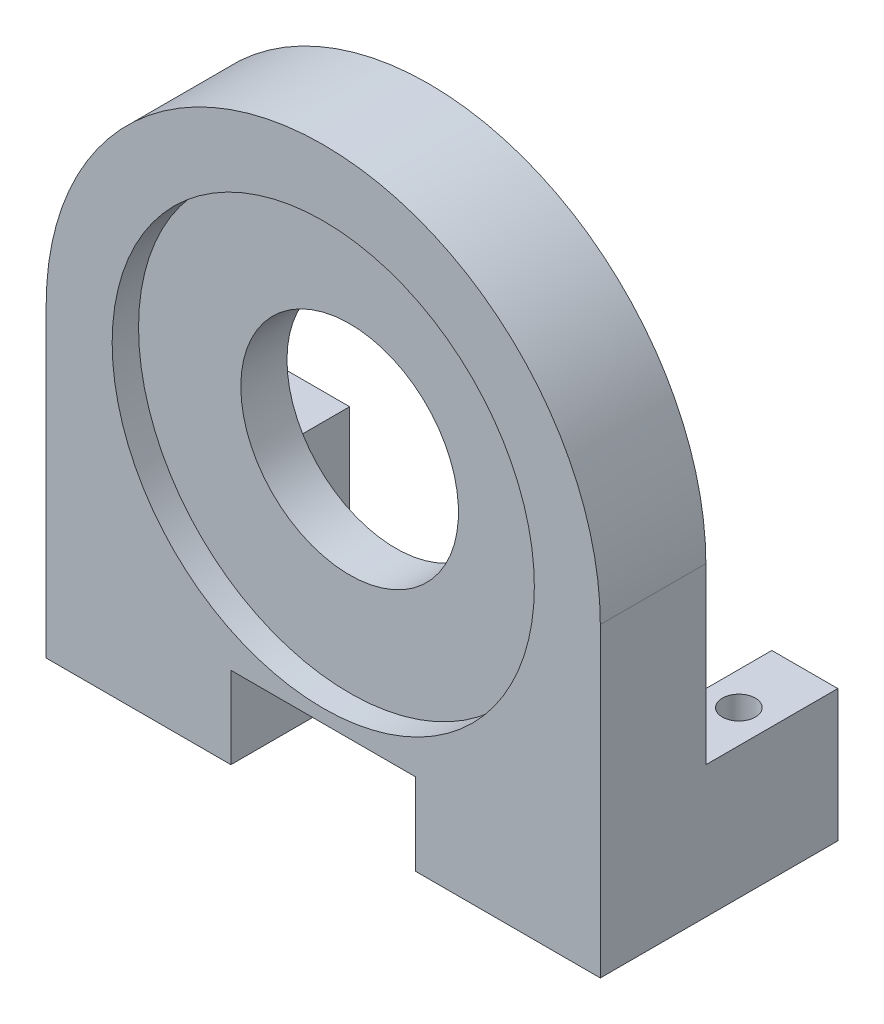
ISO-10303-21;
HEADER;
FILE_DESCRIPTION(('STEP AP214'),'2;1');
FILE_NAME('part.step','',(''),(''),'','','');
FILE_SCHEMA(('AUTOMOTIVE_DESIGN { 1 0 10303 214 1 1 1 1 }'));
ENDSEC;
DATA;
#1=APPLICATION_CONTEXT('core data for automotive mechanical design processes');
#2=APPLICATION_PROTOCOL_DEFINITION('international standard','automotive_design',2000,#1);
#3=PRODUCT_CONTEXT('',#1,'mechanical');
#4=PRODUCT('Part','Part','',(#3));
#5=PRODUCT_RELATED_PRODUCT_CATEGORY('part','',(#4));
#6=PRODUCT_DEFINITION_FORMATION('','',#4);
#7=PRODUCT_DEFINITION_CONTEXT('part definition',#1,'design');
#8=PRODUCT_DEFINITION('design','',#6,#7);
#9=PRODUCT_DEFINITION_SHAPE('','',#8);
#10=(LENGTH_UNIT() NAMED_UNIT(*) SI_UNIT(.MILLI.,.METRE.));
#11=(NAMED_UNIT(*) PLANE_ANGLE_UNIT() SI_UNIT($,.RADIAN.));
#12=(NAMED_UNIT(*) SI_UNIT($,.STERADIAN.) SOLID_ANGLE_UNIT());
#13=UNCERTAINTY_MEASURE_WITH_UNIT(LENGTH_MEASURE(1.E-05),#10,'distance_accuracy_value','');
#14=(GEOMETRIC_REPRESENTATION_CONTEXT(3) GLOBAL_UNCERTAINTY_ASSIGNED_CONTEXT((#13)) GLOBAL_UNIT_ASSIGNED_CONTEXT((#10,
#11,#12)) REPRESENTATION_CONTEXT('',''));
#15=CARTESIAN_POINT('',(0.,0.,0.));
#16=DIRECTION('',(0.,0.,1.));
#17=DIRECTION('',(1.,0.,0.));
#18=AXIS2_PLACEMENT_3D('',#15,#16,#17);
#19=CARTESIAN_POINT('',(-21.,0.,4.));
#20=DIRECTION('',(0.,1.,0.));
#21=DIRECTION('',(-1.,0.,0.));
#22=AXIS2_PLACEMENT_3D('',#19,#20,#21);
#23=PLANE('',#22);
#24=CARTESIAN_POINT('',(18.5,0.,-0.999999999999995));
#25=DIRECTION('',(0.,-1.,0.));
#26=DIRECTION('',(0.,0.,1.));
#27=AXIS2_PLACEMENT_3D('',#24,#25,#26);
#28=CIRCLE('',#27,1.25);
#29=CARTESIAN_POINT('',(18.5,0.,0.250000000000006));
#30=VERTEX_POINT('',#29);
#31=EDGE_CURVE('E169',#30,#30,#28,.T.);
#32=ORIENTED_EDGE('',*,*,#31,.F.);
#33=EDGE_LOOP('',(#32));
#34=FACE_BOUND('',#33,.T.);
#35=CARTESIAN_POINT('',(18.5,0.,-9.));
#36=DIRECTION('',(0.,-1.,0.));
#37=DIRECTION('',(0.,0.,1.));
#38=AXIS2_PLACEMENT_3D('',#35,#36,#37);
#39=CIRCLE('',#38,1.25);
#40=CARTESIAN_POINT('',(18.5,0.,-7.74999999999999));
#41=VERTEX_POINT('',#40);
#42=EDGE_CURVE('E177',#41,#41,#39,.T.);
#43=ORIENTED_EDGE('',*,*,#42,.F.);
#44=EDGE_LOOP('',(#43));
#45=FACE_BOUND('',#44,.T.);
#46=DIRECTION('',(1.,0.,0.));
#47=VECTOR('',#46,1.);
#48=CARTESIAN_POINT('',(-21.,0.,4.));
#49=LINE('',#48,#47);
#50=CARTESIAN_POINT('',(7.,0.,4.));
#51=VERTEX_POINT('',#50);
#52=CARTESIAN_POINT('',(21.,0.,4.));
#53=VERTEX_POINT('',#52);
#54=EDGE_CURVE('E258',#51,#53,#49,.T.);
#55=ORIENTED_EDGE('',*,*,#54,.F.);
#56=DIRECTION('',(0.,0.,-1.));
#57=VECTOR('',#56,1.);
#58=CARTESIAN_POINT('',(7.,0.,4.));
#59=LINE('',#58,#57);
#60=CARTESIAN_POINT('',(7.,0.,-4.));
#61=VERTEX_POINT('',#60);
#62=EDGE_CURVE('E12',#51,#61,#59,.T.);
#63=ORIENTED_EDGE('',*,*,#62,.T.);
#64=DIRECTION('',(1.,0.,0.));
#65=VECTOR('',#64,1.);
#66=CARTESIAN_POINT('',(-21.,0.,-4.));
#67=LINE('',#66,#65);
#68=CARTESIAN_POINT('',(16.,0.,-4.));
#69=VERTEX_POINT('',#68);
#70=EDGE_CURVE('E268',#61,#69,#67,.T.);
#71=ORIENTED_EDGE('',*,*,#70,.T.);
#72=DIRECTION('',(0.,0.,1.));
#73=VECTOR('',#72,1.);
#74=CARTESIAN_POINT('',(16.,0.,-14.));
#75=LINE('',#74,#73);
#76=CARTESIAN_POINT('',(16.,0.,-14.));
#77=VERTEX_POINT('',#76);
#78=EDGE_CURVE('E234',#77,#69,#75,.T.);
#79=ORIENTED_EDGE('',*,*,#78,.F.);
#80=DIRECTION('',(-1.,0.,0.));
#81=VECTOR('',#80,1.);
#82=CARTESIAN_POINT('',(21.,0.,-14.));
#83=LINE('',#82,#81);
#84=CARTESIAN_POINT('',(21.,0.,-14.));
#85=VERTEX_POINT('',#84);
#86=EDGE_CURVE('E217',#85,#77,#83,.T.);
#87=ORIENTED_EDGE('',*,*,#86,.F.);
#88=DIRECTION('',(0.,0.,-1.));
#89=VECTOR('',#88,1.);
#90=CARTESIAN_POINT('',(21.,0.,4.));
#91=LINE('',#90,#89);
#92=EDGE_CURVE('E279',#53,#85,#91,.T.);
#93=ORIENTED_EDGE('',*,*,#92,.F.);
#94=EDGE_LOOP('',(#55,#63,#71,#79,#87,#93));
#95=FACE_BOUND('',#94,.T.);
#96=ADVANCED_FACE('F37',(#34,#45,#95),#23,.F.);
#97=CARTESIAN_POINT('',(0.,23.2,-4.));
#98=DIRECTION('',(0.,0.,-1.));
#99=DIRECTION('',(-1.,0.,0.));
#100=AXIS2_PLACEMENT_3D('',#97,#98,#99);
#101=PLANE('',#100);
#102=DIRECTION('',(0.,-1.,0.));
#103=VECTOR('',#102,1.);
#104=CARTESIAN_POINT('',(7.,-6.20000000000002,-4.));
#105=LINE('',#104,#103);
#106=CARTESIAN_POINT('',(7.,6.20000000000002,-4.));
#107=VERTEX_POINT('',#106);
#108=EDGE_CURVE('E161',#107,#61,#105,.T.);
#109=ORIENTED_EDGE('',*,*,#108,.F.);
#110=DIRECTION('',(1.,0.,0.));
#111=VECTOR('',#110,1.);
#112=CARTESIAN_POINT('',(7.,6.20000000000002,-4.));
#113=LINE('',#112,#111);
#114=CARTESIAN_POINT('',(-7.,6.20000000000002,-4.));
#115=VERTEX_POINT('',#114);
#116=EDGE_CURVE('E163',#115,#107,#113,.T.);
#117=ORIENTED_EDGE('',*,*,#116,.F.);
#118=DIRECTION('',(0.,1.,0.));
#119=VECTOR('',#118,1.);
#120=CARTESIAN_POINT('',(-7.,-6.20000000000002,-4.));
#121=LINE('',#120,#119);
#122=CARTESIAN_POINT('',(-7.,0.,-4.));
#123=VERTEX_POINT('',#122);
#124=EDGE_CURVE('E142',#123,#115,#121,.T.);
#125=ORIENTED_EDGE('',*,*,#124,.F.);
#126=CARTESIAN_POINT('',(-16.,0.,-4.));
#127=VERTEX_POINT('',#126);
#128=EDGE_CURVE('E269',#127,#123,#67,.T.);
#129=ORIENTED_EDGE('',*,*,#128,.F.);
#130=DIRECTION('',(0.,-1.,0.));
#131=VECTOR('',#130,1.);
#132=CARTESIAN_POINT('',(-16.,0.,-4.));
#133=LINE('',#132,#131);
#134=CARTESIAN_POINT('',(-16.,10.,-4.));
#135=VERTEX_POINT('',#134);
#136=EDGE_CURVE('E199',#135,#127,#133,.T.);
#137=ORIENTED_EDGE('',*,*,#136,.F.);
#138=DIRECTION('',(1.,0.,0.));
#139=VECTOR('',#138,1.);
#140=CARTESIAN_POINT('',(-21.,10.,-4.));
#141=LINE('',#140,#139);
#142=CARTESIAN_POINT('',(-21.,10.,-4.));
#143=VERTEX_POINT('',#142);
#144=EDGE_CURVE('E194',#143,#135,#141,.T.);
#145=ORIENTED_EDGE('',*,*,#144,.F.);
#146=DIRECTION('',(0.,-1.,0.));
#147=VECTOR('',#146,1.);
#148=CARTESIAN_POINT('',(-21.,0.,-4.));
#149=LINE('',#148,#147);
#150=CARTESIAN_POINT('',(-21.,23.2,-4.));
#151=VERTEX_POINT('',#150);
#152=EDGE_CURVE('E253',#151,#143,#149,.T.);
#153=ORIENTED_EDGE('',*,*,#152,.F.);
#154=CARTESIAN_POINT('',(0.,23.2,-4.));
#155=DIRECTION('',(0.,0.,1.));
#156=DIRECTION('',(-1.,0.,0.));
#157=AXIS2_PLACEMENT_3D('',#154,#155,#156);
#158=CIRCLE('',#157,21.);
#159=CARTESIAN_POINT('',(21.,23.2,-4.));
#160=VERTEX_POINT('',#159);
#161=EDGE_CURVE('E259',#160,#151,#158,.T.);
#162=ORIENTED_EDGE('',*,*,#161,.F.);
#163=DIRECTION('',(0.,1.,0.));
#164=VECTOR('',#163,1.);
#165=CARTESIAN_POINT('',(21.,23.2,-4.));
#166=LINE('',#165,#164);
#167=CARTESIAN_POINT('',(21.,10.,-4.));
#168=VERTEX_POINT('',#167);
#169=EDGE_CURVE('E271',#168,#160,#166,.T.);
#170=ORIENTED_EDGE('',*,*,#169,.F.);
#171=DIRECTION('',(1.,0.,0.));
#172=VECTOR('',#171,1.);
#173=CARTESIAN_POINT('',(21.,10.,-4.));
#174=LINE('',#173,#172);
#175=CARTESIAN_POINT('',(16.,10.,-4.));
#176=VERTEX_POINT('',#175);
#177=EDGE_CURVE('E218',#176,#168,#174,.T.);
#178=ORIENTED_EDGE('',*,*,#177,.F.);
#179=DIRECTION('',(0.,1.,0.));
#180=VECTOR('',#179,1.);
#181=CARTESIAN_POINT('',(16.,0.,-4.));
#182=LINE('',#181,#180);
#183=EDGE_CURVE('E213',#69,#176,#182,.T.);
#184=ORIENTED_EDGE('',*,*,#183,.F.);
#185=ORIENTED_EDGE('',*,*,#70,.F.);
#186=EDGE_LOOP('',(#109,#117,#125,#129,#137,#145,#153,#162,#170,#178,#184,#185));
#187=FACE_BOUND('',#186,.T.);
#188=CARTESIAN_POINT('',(0.,23.2,-4.));
#189=DIRECTION('',(0.,0.,1.));
#190=DIRECTION('',(1.,0.,0.));
#191=AXIS2_PLACEMENT_3D('',#188,#189,#190);
#192=CIRCLE('',#191,16.);
#193=CARTESIAN_POINT('',(16.,23.2,-4.));
#194=VERTEX_POINT('',#193);
#195=EDGE_CURVE('E249',#194,#194,#192,.T.);
#196=ORIENTED_EDGE('',*,*,#195,.T.);
#197=EDGE_LOOP('',(#196));
#198=FACE_BOUND('',#197,.T.);
#199=ADVANCED_FACE('F286',(#187,#198),#101,.T.);
#200=CARTESIAN_POINT('',(0.,23.2,4.));
#201=DIRECTION('',(0.,0.,-1.));
#202=DIRECTION('',(-1.,0.,0.));
#203=AXIS2_PLACEMENT_3D('',#200,#201,#202);
#204=CYLINDRICAL_SURFACE('',#203,16.);
#205=CARTESIAN_POINT('',(0.,23.2,4.));
#206=DIRECTION('',(0.,0.,1.));
#207=DIRECTION('',(1.,0.,0.));
#208=AXIS2_PLACEMENT_3D('',#205,#206,#207);
#209=CIRCLE('',#208,16.);
#210=CARTESIAN_POINT('',(16.,23.2,4.));
#211=VERTEX_POINT('',#210);
#212=EDGE_CURVE('E250',#211,#211,#209,.T.);
#213=ORIENTED_EDGE('',*,*,#212,.T.);
#214=EDGE_LOOP('',(#213));
#215=FACE_BOUND('',#214,.T.);
#216=CARTESIAN_POINT('',(0.,23.2,2.));
#217=DIRECTION('',(0.,0.,-1.));
#218=DIRECTION('',(-1.,0.,0.));
#219=AXIS2_PLACEMENT_3D('',#216,#217,#218);
#220=CIRCLE('',#219,16.);
#221=CARTESIAN_POINT('',(-16.,23.2,2.));
#222=VERTEX_POINT('',#221);
#223=EDGE_CURVE('E243',#222,#222,#220,.T.);
#224=ORIENTED_EDGE('',*,*,#223,.T.);
#225=EDGE_LOOP('',(#224));
#226=FACE_BOUND('',#225,.T.);
#227=ADVANCED_FACE('F341',(#215,#226),#204,.F.);
#228=ORIENTED_EDGE('',*,*,#195,.F.);
#229=EDGE_LOOP('',(#228));
#230=FACE_BOUND('',#229,.T.);
#231=CARTESIAN_POINT('',(0.,23.2,-1.5));
#232=DIRECTION('',(0.,0.,1.));
#233=DIRECTION('',(1.,0.,0.));
#234=AXIS2_PLACEMENT_3D('',#231,#232,#233);
#235=CIRCLE('',#234,16.);
#236=CARTESIAN_POINT('',(16.,23.2,-1.5));
#237=VERTEX_POINT('',#236);
#238=EDGE_CURVE('E240',#237,#237,#235,.T.);
#239=ORIENTED_EDGE('',*,*,#238,.T.);
#240=EDGE_LOOP('',(#239));
#241=FACE_BOUND('',#240,.T.);
#242=ADVANCED_FACE('F434',(#230,#241),#204,.F.);
#243=CARTESIAN_POINT('',(0.,23.2,4.));
#244=DIRECTION('',(0.,0.,-1.));
#245=DIRECTION('',(-1.,0.,0.));
#246=AXIS2_PLACEMENT_3D('',#243,#244,#245);
#247=PLANE('',#246);
#248=DIRECTION('',(1.,0.,0.));
#249=VECTOR('',#248,1.);
#250=CARTESIAN_POINT('',(7.,6.20000000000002,4.));
#251=LINE('',#250,#249);
#252=CARTESIAN_POINT('',(-7.,6.20000000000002,4.));
#253=VERTEX_POINT('',#252);
#254=CARTESIAN_POINT('',(7.,6.20000000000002,4.));
#255=VERTEX_POINT('',#254);
#256=EDGE_CURVE('E150',#253,#255,#251,.T.);
#257=ORIENTED_EDGE('',*,*,#256,.T.);
#258=DIRECTION('',(0.,-1.,0.));
#259=VECTOR('',#258,1.);
#260=CARTESIAN_POINT('',(7.,-6.20000000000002,4.));
#261=LINE('',#260,#259);
#262=EDGE_CURVE('E147',#255,#51,#261,.T.);
#263=ORIENTED_EDGE('',*,*,#262,.T.);
#264=ORIENTED_EDGE('',*,*,#54,.T.);
#265=DIRECTION('',(0.,1.,0.));
#266=VECTOR('',#265,1.);
#267=CARTESIAN_POINT('',(21.,23.2,4.));
#268=LINE('',#267,#266);
#269=CARTESIAN_POINT('',(21.,23.2,4.));
#270=VERTEX_POINT('',#269);
#271=EDGE_CURVE('E261',#53,#270,#268,.T.);
#272=ORIENTED_EDGE('',*,*,#271,.T.);
#273=CARTESIAN_POINT('',(0.,23.2,4.));
#274=DIRECTION('',(0.,0.,1.));
#275=DIRECTION('',(-1.,0.,0.));
#276=AXIS2_PLACEMENT_3D('',#273,#274,#275);
#277=CIRCLE('',#276,21.);
#278=CARTESIAN_POINT('',(-21.,23.2,4.));
#279=VERTEX_POINT('',#278);
#280=EDGE_CURVE('E263',#270,#279,#277,.T.);
#281=ORIENTED_EDGE('',*,*,#280,.T.);
#282=DIRECTION('',(0.,-1.,0.));
#283=VECTOR('',#282,1.);
#284=CARTESIAN_POINT('',(-21.,0.,4.));
#285=LINE('',#284,#283);
#286=CARTESIAN_POINT('',(-21.,0.,4.));
#287=VERTEX_POINT('',#286);
#288=EDGE_CURVE('E256',#279,#287,#285,.T.);
#289=ORIENTED_EDGE('',*,*,#288,.T.);
#290=CARTESIAN_POINT('',(-7.,0.,4.));
#291=VERTEX_POINT('',#290);
#292=EDGE_CURVE('E160',#287,#291,#49,.T.);
#293=ORIENTED_EDGE('',*,*,#292,.T.);
#294=DIRECTION('',(0.,1.,0.));
#295=VECTOR('',#294,1.);
#296=CARTESIAN_POINT('',(-7.,-6.20000000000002,4.));
#297=LINE('',#296,#295);
#298=EDGE_CURVE('E52',#291,#253,#297,.T.);
#299=ORIENTED_EDGE('',*,*,#298,.T.);
#300=EDGE_LOOP('',(#257,#263,#264,#272,#281,#289,#293,#299));
#301=FACE_BOUND('',#300,.T.);
#302=ORIENTED_EDGE('',*,*,#212,.F.);
#303=EDGE_LOOP('',(#302));
#304=FACE_BOUND('',#303,.T.);
#305=ADVANCED_FACE('F157',(#301,#304),#247,.F.);
#306=CARTESIAN_POINT('',(-21.,0.,4.));
#307=DIRECTION('',(1.,0.,0.));
#308=DIRECTION('',(0.,0.,-1.));
#309=AXIS2_PLACEMENT_3D('',#306,#307,#308);
#310=PLANE('',#309);
#311=ORIENTED_EDGE('',*,*,#152,.T.);
#312=DIRECTION('',(0.,0.,1.));
#313=VECTOR('',#312,1.);
#314=CARTESIAN_POINT('',(-21.,10.,-14.));
#315=LINE('',#314,#313);
#316=CARTESIAN_POINT('',(-21.,10.,-14.));
#317=VERTEX_POINT('',#316);
#318=EDGE_CURVE('E211',#317,#143,#315,.T.);
#319=ORIENTED_EDGE('',*,*,#318,.F.);
#320=DIRECTION('',(0.,1.,0.));
#321=VECTOR('',#320,1.);
#322=CARTESIAN_POINT('',(-21.,0.,-14.));
#323=LINE('',#322,#321);
#324=CARTESIAN_POINT('',(-21.,0.,-14.));
#325=VERTEX_POINT('',#324);
#326=EDGE_CURVE('E198',#325,#317,#323,.T.);
#327=ORIENTED_EDGE('',*,*,#326,.F.);
#328=DIRECTION('',(0.,0.,-1.));
#329=VECTOR('',#328,1.);
#330=CARTESIAN_POINT('',(-21.,0.,4.));
#331=LINE('',#330,#329);
#332=EDGE_CURVE('E281',#287,#325,#331,.T.);
#333=ORIENTED_EDGE('',*,*,#332,.F.);
#334=ORIENTED_EDGE('',*,*,#288,.F.);
#335=DIRECTION('',(0.,0.,-1.));
#336=VECTOR('',#335,1.);
#337=CARTESIAN_POINT('',(-21.,23.2,4.));
#338=LINE('',#337,#336);
#339=EDGE_CURVE('E265',#279,#151,#338,.T.);
#340=ORIENTED_EDGE('',*,*,#339,.T.);
#341=EDGE_LOOP('',(#311,#319,#327,#333,#334,#340));
#342=FACE_BOUND('',#341,.T.);
#343=ADVANCED_FACE('F39',(#342),#310,.F.);
#344=CARTESIAN_POINT('',(-18.5,0.,-1.));
#345=DIRECTION('',(0.,-1.,0.));
#346=DIRECTION('',(0.,0.,-1.));
#347=AXIS2_PLACEMENT_3D('',#344,#345,#346);
#348=CIRCLE('',#347,1.25);
#349=CARTESIAN_POINT('',(-18.5,0.,-2.25));
#350=VERTEX_POINT('',#349);
#351=EDGE_CURVE('E176',#350,#350,#348,.T.);
#352=ORIENTED_EDGE('',*,*,#351,.F.);
#353=EDGE_LOOP('',(#352));
#354=FACE_BOUND('',#353,.T.);
#355=CARTESIAN_POINT('',(-18.5,0.,-9.));
#356=DIRECTION('',(0.,-1.,0.));
#357=DIRECTION('',(0.,0.,-1.));
#358=AXIS2_PLACEMENT_3D('',#355,#356,#357);
#359=CIRCLE('',#358,1.25);
#360=CARTESIAN_POINT('',(-18.5,0.,-10.25));
#361=VERTEX_POINT('',#360);
#362=EDGE_CURVE('E184',#361,#361,#359,.T.);
#363=ORIENTED_EDGE('',*,*,#362,.F.);
#364=EDGE_LOOP('',(#363));
#365=FACE_BOUND('',#364,.T.);
#366=ORIENTED_EDGE('',*,*,#128,.T.);
#367=DIRECTION('',(0.,0.,1.));
#368=VECTOR('',#367,1.);
#369=CARTESIAN_POINT('',(-7.,0.,4.));
#370=LINE('',#369,#368);
#371=EDGE_CURVE('E45',#123,#291,#370,.T.);
#372=ORIENTED_EDGE('',*,*,#371,.T.);
#373=ORIENTED_EDGE('',*,*,#292,.F.);
#374=ORIENTED_EDGE('',*,*,#332,.T.);
#375=DIRECTION('',(-1.,0.,0.));
#376=VECTOR('',#375,1.);
#377=CARTESIAN_POINT('',(-21.,0.,-14.));
#378=LINE('',#377,#376);
#379=CARTESIAN_POINT('',(-16.,0.,-14.));
#380=VERTEX_POINT('',#379);
#381=EDGE_CURVE('E195',#380,#325,#378,.T.);
#382=ORIENTED_EDGE('',*,*,#381,.F.);
#383=DIRECTION('',(0.,0.,1.));
#384=VECTOR('',#383,1.);
#385=CARTESIAN_POINT('',(-16.,0.,-14.));
#386=LINE('',#385,#384);
#387=EDGE_CURVE('E60',#380,#127,#386,.T.);
#388=ORIENTED_EDGE('',*,*,#387,.T.);
#389=EDGE_LOOP('',(#366,#372,#373,#374,#382,#388));
#390=FACE_BOUND('',#389,.T.);
#391=ADVANCED_FACE('F282',(#354,#365,#390),#23,.F.);
#392=CARTESIAN_POINT('',(21.,23.2,4.));
#393=DIRECTION('',(-1.,0.,0.));
#394=DIRECTION('',(0.,0.,1.));
#395=AXIS2_PLACEMENT_3D('',#392,#393,#394);
#396=PLANE('',#395);
#397=ORIENTED_EDGE('',*,*,#92,.T.);
#398=DIRECTION('',(0.,-1.,0.));
#399=VECTOR('',#398,1.);
#400=CARTESIAN_POINT('',(21.,0.,-14.));
#401=LINE('',#400,#399);
#402=CARTESIAN_POINT('',(21.,10.,-14.));
#403=VERTEX_POINT('',#402);
#404=EDGE_CURVE('E214',#403,#85,#401,.T.);
#405=ORIENTED_EDGE('',*,*,#404,.F.);
#406=DIRECTION('',(0.,0.,1.));
#407=VECTOR('',#406,1.);
#408=CARTESIAN_POINT('',(21.,10.,-14.));
#409=LINE('',#408,#407);
#410=EDGE_CURVE('E224',#403,#168,#409,.T.);
#411=ORIENTED_EDGE('',*,*,#410,.T.);
#412=ORIENTED_EDGE('',*,*,#169,.T.);
#413=DIRECTION('',(0.,0.,-1.));
#414=VECTOR('',#413,1.);
#415=CARTESIAN_POINT('',(21.,23.2,4.));
#416=LINE('',#415,#414);
#417=EDGE_CURVE('E276',#270,#160,#416,.T.);
#418=ORIENTED_EDGE('',*,*,#417,.F.);
#419=ORIENTED_EDGE('',*,*,#271,.F.);
#420=EDGE_LOOP('',(#397,#405,#411,#412,#418,#419));
#421=FACE_BOUND('',#420,.T.);
#422=ADVANCED_FACE('F303',(#421),#396,.F.);
#423=CARTESIAN_POINT('',(0.,23.2,4.));
#424=DIRECTION('',(0.,0.,-1.));
#425=DIRECTION('',(-1.,0.,0.));
#426=AXIS2_PLACEMENT_3D('',#423,#424,#425);
#427=CYLINDRICAL_SURFACE('',#426,21.);
#428=ORIENTED_EDGE('',*,*,#161,.T.);
#429=ORIENTED_EDGE('',*,*,#339,.F.);
#430=ORIENTED_EDGE('',*,*,#280,.F.);
#431=ORIENTED_EDGE('',*,*,#417,.T.);
#432=EDGE_LOOP('',(#428,#429,#430,#431));
#433=FACE_BOUND('',#432,.T.);
#434=ADVANCED_FACE('F306',(#433),#427,.T.);
#435=CARTESIAN_POINT('',(0.,23.2,49.254833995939));
#436=DIRECTION('',(0.,0.,-1.));
#437=DIRECTION('',(-1.,0.,0.));
#438=AXIS2_PLACEMENT_3D('',#435,#436,#437);
#439=CYLINDRICAL_SURFACE('',#438,8.25);
#440=CARTESIAN_POINT('',(0.,23.2,2.));
#441=DIRECTION('',(0.,0.,-1.));
#442=DIRECTION('',(-1.,0.,0.));
#443=AXIS2_PLACEMENT_3D('',#440,#441,#442);
#444=CIRCLE('',#443,8.25);
#445=CARTESIAN_POINT('',(-8.25000000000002,23.2,2.));
#446=VERTEX_POINT('',#445);
#447=EDGE_CURVE('E246',#446,#446,#444,.T.);
#448=ORIENTED_EDGE('',*,*,#447,.F.);
#449=EDGE_LOOP('',(#448));
#450=FACE_BOUND('',#449,.T.);
#451=CARTESIAN_POINT('',(0.,23.2,-1.5));
#452=DIRECTION('',(0.,0.,1.));
#453=DIRECTION('',(1.,0.,0.));
#454=AXIS2_PLACEMENT_3D('',#451,#452,#453);
#455=CIRCLE('',#454,8.25);
#456=CARTESIAN_POINT('',(8.24999999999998,23.2,-1.5));
#457=VERTEX_POINT('',#456);
#458=EDGE_CURVE('E237',#457,#457,#455,.T.);
#459=ORIENTED_EDGE('',*,*,#458,.F.);
#460=EDGE_LOOP('',(#459));
#461=FACE_BOUND('',#460,.T.);
#462=ADVANCED_FACE('F543',(#450,#461),#439,.F.);
#463=CARTESIAN_POINT('',(0.,23.2,2.));
#464=DIRECTION('',(0.,0.,-1.));
#465=DIRECTION('',(-1.,0.,0.));
#466=AXIS2_PLACEMENT_3D('',#463,#464,#465);
#467=PLANE('',#466);
#468=ORIENTED_EDGE('',*,*,#447,.T.);
#469=EDGE_LOOP('',(#468));
#470=FACE_BOUND('',#469,.T.);
#471=ORIENTED_EDGE('',*,*,#223,.F.);
#472=EDGE_LOOP('',(#471));
#473=FACE_BOUND('',#472,.T.);
#474=ADVANCED_FACE('F536',(#470,#473),#467,.F.);
#475=CARTESIAN_POINT('',(0.,23.2,-1.5));
#476=DIRECTION('',(0.,0.,1.));
#477=DIRECTION('',(1.,0.,0.));
#478=AXIS2_PLACEMENT_3D('',#475,#476,#477);
#479=PLANE('',#478);
#480=ORIENTED_EDGE('',*,*,#458,.T.);
#481=EDGE_LOOP('',(#480));
#482=FACE_BOUND('',#481,.T.);
#483=ORIENTED_EDGE('',*,*,#238,.F.);
#484=EDGE_LOOP('',(#483));
#485=FACE_BOUND('',#484,.T.);
#486=ADVANCED_FACE('F466',(#482,#485),#479,.F.);
#487=CARTESIAN_POINT('',(16.,0.,-14.));
#488=DIRECTION('',(1.,0.,0.));
#489=DIRECTION('',(0.,0.,-1.));
#490=AXIS2_PLACEMENT_3D('',#487,#488,#489);
#491=PLANE('',#490);
#492=ORIENTED_EDGE('',*,*,#183,.T.);
#493=DIRECTION('',(0.,0.,1.));
#494=VECTOR('',#493,1.);
#495=CARTESIAN_POINT('',(16.,10.,-14.));
#496=LINE('',#495,#494);
#497=CARTESIAN_POINT('',(16.,10.,-14.));
#498=VERTEX_POINT('',#497);
#499=EDGE_CURVE('E231',#498,#176,#496,.T.);
#500=ORIENTED_EDGE('',*,*,#499,.F.);
#501=DIRECTION('',(0.,1.,0.));
#502=VECTOR('',#501,1.);
#503=CARTESIAN_POINT('',(16.,0.,-14.));
#504=LINE('',#503,#502);
#505=EDGE_CURVE('E220',#77,#498,#504,.T.);
#506=ORIENTED_EDGE('',*,*,#505,.F.);
#507=ORIENTED_EDGE('',*,*,#78,.T.);
#508=EDGE_LOOP('',(#492,#500,#506,#507));
#509=FACE_BOUND('',#508,.T.);
#510=ADVANCED_FACE('F461',(#509),#491,.F.);
#511=CARTESIAN_POINT('',(21.,10.,-14.));
#512=DIRECTION('',(0.,-1.,0.));
#513=DIRECTION('',(0.,0.,-1.));
#514=AXIS2_PLACEMENT_3D('',#511,#512,#513);
#515=PLANE('',#514);
#516=CARTESIAN_POINT('',(18.5,9.99999999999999,-9.));
#517=DIRECTION('',(0.,-1.,0.));
#518=DIRECTION('',(1.,0.,0.));
#519=AXIS2_PLACEMENT_3D('',#516,#517,#518);
#520=CIRCLE('',#519,1.25);
#521=CARTESIAN_POINT('',(19.75,9.99999999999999,-9.));
#522=VERTEX_POINT('',#521);
#523=EDGE_CURVE('E180',#522,#522,#520,.F.);
#524=ORIENTED_EDGE('',*,*,#523,.F.);
#525=EDGE_LOOP('',(#524));
#526=FACE_BOUND('',#525,.T.);
#527=ORIENTED_EDGE('',*,*,#177,.T.);
#528=ORIENTED_EDGE('',*,*,#410,.F.);
#529=DIRECTION('',(1.,0.,0.));
#530=VECTOR('',#529,1.);
#531=CARTESIAN_POINT('',(21.,10.,-14.));
#532=LINE('',#531,#530);
#533=EDGE_CURVE('E222',#498,#403,#532,.T.);
#534=ORIENTED_EDGE('',*,*,#533,.F.);
#535=ORIENTED_EDGE('',*,*,#499,.T.);
#536=EDGE_LOOP('',(#527,#528,#534,#535));
#537=FACE_BOUND('',#536,.T.);
#538=ADVANCED_FACE('F332',(#526,#537),#515,.F.);
#539=CARTESIAN_POINT('',(0.,0.,-14.));
#540=DIRECTION('',(0.,0.,1.));
#541=DIRECTION('',(1.,0.,0.));
#542=AXIS2_PLACEMENT_3D('',#539,#540,#541);
#543=PLANE('',#542);
#544=ORIENTED_EDGE('',*,*,#404,.T.);
#545=ORIENTED_EDGE('',*,*,#86,.T.);
#546=ORIENTED_EDGE('',*,*,#505,.T.);
#547=ORIENTED_EDGE('',*,*,#533,.T.);
#548=EDGE_LOOP('',(#544,#545,#546,#547));
#549=FACE_BOUND('',#548,.T.);
#550=ADVANCED_FACE('F324',(#549),#543,.F.);
#551=CARTESIAN_POINT('',(-21.,10.,-14.));
#552=DIRECTION('',(0.,-1.,0.));
#553=DIRECTION('',(1.,0.,0.));
#554=AXIS2_PLACEMENT_3D('',#551,#552,#553);
#555=PLANE('',#554);
#556=CARTESIAN_POINT('',(-18.5,10.,-9.));
#557=DIRECTION('',(0.,-1.,0.));
#558=DIRECTION('',(1.,0.,0.));
#559=AXIS2_PLACEMENT_3D('',#556,#557,#558);
#560=CIRCLE('',#559,1.25);
#561=CARTESIAN_POINT('',(-17.25,10.,-9.));
#562=VERTEX_POINT('',#561);
#563=EDGE_CURVE('E191',#562,#562,#560,.F.);
#564=ORIENTED_EDGE('',*,*,#563,.F.);
#565=EDGE_LOOP('',(#564));
#566=FACE_BOUND('',#565,.T.);
#567=ORIENTED_EDGE('',*,*,#144,.T.);
#568=DIRECTION('',(0.,0.,1.));
#569=VECTOR('',#568,1.);
#570=CARTESIAN_POINT('',(-16.,10.,-14.));
#571=LINE('',#570,#569);
#572=CARTESIAN_POINT('',(-16.,10.,-14.));
#573=VERTEX_POINT('',#572);
#574=EDGE_CURVE('E208',#573,#135,#571,.T.);
#575=ORIENTED_EDGE('',*,*,#574,.F.);
#576=DIRECTION('',(1.,0.,0.));
#577=VECTOR('',#576,1.);
#578=CARTESIAN_POINT('',(-21.,10.,-14.));
#579=LINE('',#578,#577);
#580=EDGE_CURVE('E201',#317,#573,#579,.T.);
#581=ORIENTED_EDGE('',*,*,#580,.F.);
#582=ORIENTED_EDGE('',*,*,#318,.T.);
#583=EDGE_LOOP('',(#567,#575,#581,#582));
#584=FACE_BOUND('',#583,.T.);
#585=ADVANCED_FACE('F322',(#566,#584),#555,.F.);
#586=CARTESIAN_POINT('',(-16.,0.,-14.));
#587=DIRECTION('',(-1.,0.,0.));
#588=DIRECTION('',(0.,-1.,0.));
#589=AXIS2_PLACEMENT_3D('',#586,#587,#588);
#590=PLANE('',#589);
#591=ORIENTED_EDGE('',*,*,#136,.T.);
#592=ORIENTED_EDGE('',*,*,#387,.F.);
#593=DIRECTION('',(0.,-1.,0.));
#594=VECTOR('',#593,1.);
#595=CARTESIAN_POINT('',(-16.,0.,-14.));
#596=LINE('',#595,#594);
#597=EDGE_CURVE('E203',#573,#380,#596,.T.);
#598=ORIENTED_EDGE('',*,*,#597,.F.);
#599=ORIENTED_EDGE('',*,*,#574,.T.);
#600=EDGE_LOOP('',(#591,#592,#598,#599));
#601=FACE_BOUND('',#600,.T.);
#602=ADVANCED_FACE('F319',(#601),#590,.F.);
#603=CARTESIAN_POINT('',(0.,0.,-14.));
#604=DIRECTION('',(0.,0.,1.));
#605=DIRECTION('',(1.,0.,0.));
#606=AXIS2_PLACEMENT_3D('',#603,#604,#605);
#607=PLANE('',#606);
#608=ORIENTED_EDGE('',*,*,#381,.T.);
#609=ORIENTED_EDGE('',*,*,#326,.T.);
#610=ORIENTED_EDGE('',*,*,#580,.T.);
#611=ORIENTED_EDGE('',*,*,#597,.T.);
#612=EDGE_LOOP('',(#608,#609,#610,#611));
#613=FACE_BOUND('',#612,.T.);
#614=ADVANCED_FACE('F314',(#613),#607,.F.);
#615=CARTESIAN_POINT('',(-18.5,13.5355339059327,-9.));
#616=DIRECTION('',(0.,-1.,0.));
#617=DIRECTION('',(0.,0.,-1.));
#618=AXIS2_PLACEMENT_3D('',#615,#616,#617);
#619=CYLINDRICAL_SURFACE('',#618,1.25);
#620=ORIENTED_EDGE('',*,*,#563,.T.);
#621=EDGE_LOOP('',(#620));
#622=FACE_BOUND('',#621,.T.);
#623=ORIENTED_EDGE('',*,*,#362,.T.);
#624=EDGE_LOOP('',(#623));
#625=FACE_BOUND('',#624,.T.);
#626=ADVANCED_FACE('F356',(#622,#625),#619,.F.);
#627=CARTESIAN_POINT('',(18.5,13.5355339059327,-9.));
#628=DIRECTION('',(0.,-1.,0.));
#629=DIRECTION('',(0.,0.,-1.));
#630=AXIS2_PLACEMENT_3D('',#627,#628,#629);
#631=CYLINDRICAL_SURFACE('',#630,1.25);
#632=ORIENTED_EDGE('',*,*,#523,.T.);
#633=EDGE_LOOP('',(#632));
#634=FACE_BOUND('',#633,.T.);
#635=ORIENTED_EDGE('',*,*,#42,.T.);
#636=EDGE_LOOP('',(#635));
#637=FACE_BOUND('',#636,.T.);
#638=ADVANCED_FACE('F358',(#634,#637),#631,.F.);
#639=CARTESIAN_POINT('',(18.5,13.5355339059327,-0.999999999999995));
#640=DIRECTION('',(0.,-1.,0.));
#641=DIRECTION('',(0.,0.,-1.));
#642=AXIS2_PLACEMENT_3D('',#639,#640,#641);
#643=CYLINDRICAL_SURFACE('',#642,1.25);
#644=CARTESIAN_POINT('',(18.5,9.99999999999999,-0.999999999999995));
#645=DIRECTION('',(0.,-1.,0.));
#646=DIRECTION('',(1.,0.,0.));
#647=AXIS2_PLACEMENT_3D('',#644,#645,#646);
#648=CIRCLE('',#647,1.25);
#649=CARTESIAN_POINT('',(19.75,9.99999999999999,-0.999999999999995));
#650=VERTEX_POINT('',#649);
#651=EDGE_CURVE('E173',#650,#650,#648,.F.);
#652=ORIENTED_EDGE('',*,*,#651,.T.);
#653=EDGE_LOOP('',(#652));
#654=FACE_BOUND('',#653,.T.);
#655=ORIENTED_EDGE('',*,*,#31,.T.);
#656=EDGE_LOOP('',(#655));
#657=FACE_BOUND('',#656,.T.);
#658=ADVANCED_FACE('F365',(#654,#657),#643,.F.);
#659=CARTESIAN_POINT('',(-21.,10.,-14.));
#660=DIRECTION('',(0.,-1.,0.));
#661=DIRECTION('',(1.,0.,0.));
#662=AXIS2_PLACEMENT_3D('',#659,#660,#661);
#663=PLANE('',#662);
#664=ORIENTED_EDGE('',*,*,#651,.F.);
#665=EDGE_LOOP('',(#664));
#666=FACE_BOUND('',#665,.T.);
#667=ADVANCED_FACE('F374',(#666),#663,.T.);
#668=CARTESIAN_POINT('',(-18.5,13.5355339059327,-1.));
#669=DIRECTION('',(0.,-1.,0.));
#670=DIRECTION('',(0.,0.,-1.));
#671=AXIS2_PLACEMENT_3D('',#668,#669,#670);
#672=CYLINDRICAL_SURFACE('',#671,1.25);
#673=CARTESIAN_POINT('',(-18.5,10.,-1.));
#674=DIRECTION('',(0.,-1.,0.));
#675=DIRECTION('',(1.,0.,0.));
#676=AXIS2_PLACEMENT_3D('',#673,#674,#675);
#677=CIRCLE('',#676,1.25);
#678=CARTESIAN_POINT('',(-17.25,10.,-1.));
#679=VERTEX_POINT('',#678);
#680=EDGE_CURVE('E181',#679,#679,#677,.F.);
#681=ORIENTED_EDGE('',*,*,#680,.T.);
#682=EDGE_LOOP('',(#681));
#683=FACE_BOUND('',#682,.T.);
#684=ORIENTED_EDGE('',*,*,#351,.T.);
#685=EDGE_LOOP('',(#684));
#686=FACE_BOUND('',#685,.T.);
#687=ADVANCED_FACE('F370',(#683,#686),#672,.F.);
#688=CARTESIAN_POINT('',(-21.,10.,-14.));
#689=DIRECTION('',(0.,-1.,0.));
#690=DIRECTION('',(1.,0.,0.));
#691=AXIS2_PLACEMENT_3D('',#688,#689,#690);
#692=PLANE('',#691);
#693=ORIENTED_EDGE('',*,*,#680,.F.);
#694=EDGE_LOOP('',(#693));
#695=FACE_BOUND('',#694,.T.);
#696=ADVANCED_FACE('F373',(#695),#692,.T.);
#697=CARTESIAN_POINT('',(7.,-6.20000000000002,4.));
#698=DIRECTION('',(1.,0.,0.));
#699=DIRECTION('',(0.,0.,-1.));
#700=AXIS2_PLACEMENT_3D('',#697,#698,#699);
#701=PLANE('',#700);
#702=ORIENTED_EDGE('',*,*,#262,.F.);
#703=DIRECTION('',(0.,0.,-1.));
#704=VECTOR('',#703,1.);
#705=CARTESIAN_POINT('',(7.,6.20000000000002,4.));
#706=LINE('',#705,#704);
#707=EDGE_CURVE('E146',#255,#107,#706,.T.);
#708=ORIENTED_EDGE('',*,*,#707,.T.);
#709=ORIENTED_EDGE('',*,*,#108,.T.);
#710=ORIENTED_EDGE('',*,*,#62,.F.);
#711=EDGE_LOOP('',(#702,#708,#709,#710));
#712=FACE_BOUND('',#711,.T.);
#713=ADVANCED_FACE('F292',(#712),#701,.F.);
#714=CARTESIAN_POINT('',(-7.,-6.20000000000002,4.));
#715=DIRECTION('',(-1.,0.,0.));
#716=DIRECTION('',(0.,0.,1.));
#717=AXIS2_PLACEMENT_3D('',#714,#715,#716);
#718=PLANE('',#717);
#719=ORIENTED_EDGE('',*,*,#124,.T.);
#720=DIRECTION('',(0.,0.,-1.));
#721=VECTOR('',#720,1.);
#722=CARTESIAN_POINT('',(-7.,6.20000000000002,4.));
#723=LINE('',#722,#721);
#724=EDGE_CURVE('E138',#253,#115,#723,.T.);
#725=ORIENTED_EDGE('',*,*,#724,.F.);
#726=ORIENTED_EDGE('',*,*,#298,.F.);
#727=ORIENTED_EDGE('',*,*,#371,.F.);
#728=EDGE_LOOP('',(#719,#725,#726,#727));
#729=FACE_BOUND('',#728,.T.);
#730=ADVANCED_FACE('F140',(#729),#718,.F.);
#731=CARTESIAN_POINT('',(7.,6.20000000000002,4.));
#732=DIRECTION('',(0.,1.,0.));
#733=DIRECTION('',(0.,0.,1.));
#734=AXIS2_PLACEMENT_3D('',#731,#732,#733);
#735=PLANE('',#734);
#736=ORIENTED_EDGE('',*,*,#116,.T.);
#737=ORIENTED_EDGE('',*,*,#707,.F.);
#738=ORIENTED_EDGE('',*,*,#256,.F.);
#739=ORIENTED_EDGE('',*,*,#724,.T.);
#740=EDGE_LOOP('',(#736,#737,#738,#739));
#741=FACE_BOUND('',#740,.T.);
#742=ADVANCED_FACE('F151',(#741),#735,.F.);
#743=CLOSED_SHELL('',(#96,#199,#227,#242,#305,#343,#391,#422,#434,#462,#474,#486,#510,#538,#550,
#585,#602,#614,#626,#638,#658,#667,#687,#696,#713,#730,#742));
#744=MANIFOLD_SOLID_BREP('B2',#743);
#745=ADVANCED_BREP_SHAPE_REPRESENTATION('',(#18,#744),#14);
#746=SHAPE_DEFINITION_REPRESENTATION(#9,#745);
ENDSEC;
END-ISO-10303-21;
